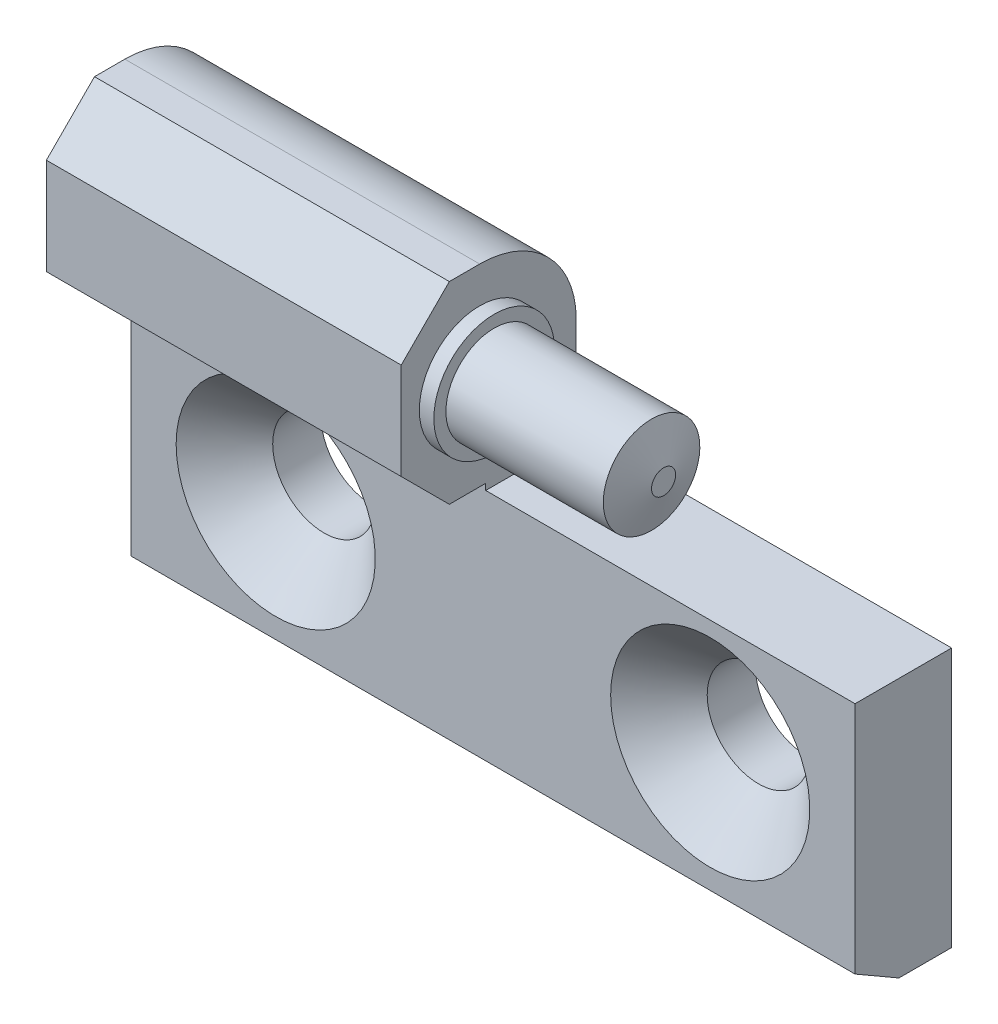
ISO-10303-21;
HEADER;
FILE_DESCRIPTION(('STEP AP214'),'2;1');
FILE_NAME('part.step','',(''),(''),'','','');
FILE_SCHEMA(('AUTOMOTIVE_DESIGN { 1 0 10303 214 1 1 1 1 }'));
ENDSEC;
DATA;
#1=APPLICATION_CONTEXT('core data for automotive mechanical design processes');
#2=APPLICATION_PROTOCOL_DEFINITION('international standard','automotive_design',2000,#1);
#3=PRODUCT_CONTEXT('',#1,'mechanical');
#4=PRODUCT('Part','Part','',(#3));
#5=PRODUCT_RELATED_PRODUCT_CATEGORY('part','',(#4));
#6=PRODUCT_DEFINITION_FORMATION('','',#4);
#7=PRODUCT_DEFINITION_CONTEXT('part definition',#1,'design');
#8=PRODUCT_DEFINITION('design','',#6,#7);
#9=PRODUCT_DEFINITION_SHAPE('','',#8);
#10=(LENGTH_UNIT() NAMED_UNIT(*) SI_UNIT(.MILLI.,.METRE.));
#11=(NAMED_UNIT(*) PLANE_ANGLE_UNIT() SI_UNIT($,.RADIAN.));
#12=(NAMED_UNIT(*) SI_UNIT($,.STERADIAN.) SOLID_ANGLE_UNIT());
#13=UNCERTAINTY_MEASURE_WITH_UNIT(LENGTH_MEASURE(1.E-05),#10,'distance_accuracy_value','');
#14=(GEOMETRIC_REPRESENTATION_CONTEXT(3) GLOBAL_UNCERTAINTY_ASSIGNED_CONTEXT((#13)) GLOBAL_UNIT_ASSIGNED_CONTEXT((#10,
#11,#12)) REPRESENTATION_CONTEXT('',''));
#15=CARTESIAN_POINT('',(0.,0.,0.));
#16=DIRECTION('',(0.,0.,1.));
#17=DIRECTION('',(1.,0.,0.));
#18=AXIS2_PLACEMENT_3D('',#15,#16,#17);
#19=CARTESIAN_POINT('',(48.,-12.,4.36269330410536));
#20=DIRECTION('',(0.,1.,0.));
#21=DIRECTION('',(-1.,0.,0.));
#22=AXIS2_PLACEMENT_3D('',#19,#20,#21);
#23=PLANE('',#22);
#24=DIRECTION('',(0.,0.,-1.));
#25=VECTOR('',#24,1.);
#26=CARTESIAN_POINT('',(-12.,-12.,4.36269330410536));
#27=LINE('',#26,#25);
#28=CARTESIAN_POINT('',(-12.,-12.,4.36269330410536));
#29=VERTEX_POINT('',#28);
#30=CARTESIAN_POINT('',(-12.,-12.,0.));
#31=VERTEX_POINT('',#30);
#32=EDGE_CURVE('E151',#29,#31,#27,.T.);
#33=ORIENTED_EDGE('',*,*,#32,.T.);
#34=DIRECTION('',(-1.,0.,0.));
#35=VECTOR('',#34,1.);
#36=CARTESIAN_POINT('',(48.,-12.,0.));
#37=LINE('',#36,#35);
#38=CARTESIAN_POINT('',(48.,-12.,0.));
#39=VERTEX_POINT('',#38);
#40=EDGE_CURVE('E132',#39,#31,#37,.T.);
#41=ORIENTED_EDGE('',*,*,#40,.F.);
#42=DIRECTION('',(0.,0.,-1.));
#43=VECTOR('',#42,1.);
#44=CARTESIAN_POINT('',(48.,-12.,4.36269330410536));
#45=LINE('',#44,#43);
#46=CARTESIAN_POINT('',(48.,-12.,4.36269330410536));
#47=VERTEX_POINT('',#46);
#48=EDGE_CURVE('E141',#47,#39,#45,.T.);
#49=ORIENTED_EDGE('',*,*,#48,.F.);
#50=DIRECTION('',(-1.,0.,0.));
#51=VECTOR('',#50,1.);
#52=CARTESIAN_POINT('',(48.,-12.,4.36269330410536));
#53=LINE('',#52,#51);
#54=EDGE_CURVE('E150',#47,#29,#53,.T.);
#55=ORIENTED_EDGE('',*,*,#54,.T.);
#56=EDGE_LOOP('',(#33,#41,#49,#55));
#57=FACE_BOUND('',#56,.T.);
#58=ADVANCED_FACE('F14',(#57),#23,.F.);
#59=CARTESIAN_POINT('',(0.,0.,0.));
#60=DIRECTION('',(0.,0.,-1.));
#61=DIRECTION('',(-1.,0.,0.));
#62=AXIS2_PLACEMENT_3D('',#59,#60,#61);
#63=CYLINDRICAL_SURFACE('',#62,4.25);
#64=CARTESIAN_POINT('',(0.,0.,0.));
#65=DIRECTION('',(0.,0.,-1.));
#66=DIRECTION('',(-1.,0.,0.));
#67=AXIS2_PLACEMENT_3D('',#64,#65,#66);
#68=CIRCLE('',#67,4.25);
#69=CARTESIAN_POINT('',(-4.25,0.,0.));
#70=VERTEX_POINT('',#69);
#71=EDGE_CURVE('E250',#70,#70,#68,.T.);
#72=ORIENTED_EDGE('',*,*,#71,.T.);
#73=EDGE_LOOP('',(#72));
#74=FACE_BOUND('',#73,.T.);
#75=CARTESIAN_POINT('',(0.,0.,4.));
#76=DIRECTION('',(0.,0.,-1.));
#77=DIRECTION('',(-1.,0.,0.));
#78=AXIS2_PLACEMENT_3D('',#75,#76,#77);
#79=CIRCLE('',#78,4.25);
#80=CARTESIAN_POINT('',(-4.25,0.,4.));
#81=VERTEX_POINT('',#80);
#82=EDGE_CURVE('E253',#81,#81,#79,.T.);
#83=ORIENTED_EDGE('',*,*,#82,.F.);
#84=EDGE_LOOP('',(#83));
#85=FACE_BOUND('',#84,.T.);
#86=ADVANCED_FACE('F280',(#74,#85),#63,.F.);
#87=CARTESIAN_POINT('',(36.,0.,0.));
#88=DIRECTION('',(0.,0.,-1.));
#89=DIRECTION('',(-1.,0.,0.));
#90=AXIS2_PLACEMENT_3D('',#87,#88,#89);
#91=CYLINDRICAL_SURFACE('',#90,4.25);
#92=CARTESIAN_POINT('',(36.,0.,0.));
#93=DIRECTION('',(0.,0.,-1.));
#94=DIRECTION('',(-1.,0.,0.));
#95=AXIS2_PLACEMENT_3D('',#92,#93,#94);
#96=CIRCLE('',#95,4.25);
#97=CARTESIAN_POINT('',(31.75,0.,0.));
#98=VERTEX_POINT('',#97);
#99=EDGE_CURVE('E241',#98,#98,#96,.T.);
#100=ORIENTED_EDGE('',*,*,#99,.T.);
#101=EDGE_LOOP('',(#100));
#102=FACE_BOUND('',#101,.T.);
#103=CARTESIAN_POINT('',(36.,0.,4.));
#104=DIRECTION('',(0.,0.,-1.));
#105=DIRECTION('',(-1.,0.,0.));
#106=AXIS2_PLACEMENT_3D('',#103,#104,#105);
#107=CIRCLE('',#106,4.25);
#108=CARTESIAN_POINT('',(31.75,0.,4.));
#109=VERTEX_POINT('',#108);
#110=EDGE_CURVE('E244',#109,#109,#107,.T.);
#111=ORIENTED_EDGE('',*,*,#110,.F.);
#112=EDGE_LOOP('',(#111));
#113=FACE_BOUND('',#112,.T.);
#114=ADVANCED_FACE('F287',(#102,#113),#91,.F.);
#115=CARTESIAN_POINT('',(48.,18.,8.5));
#116=DIRECTION('',(1.,0.,0.));
#117=DIRECTION('',(0.,1.,0.));
#118=AXIS2_PLACEMENT_3D('',#115,#116,#117);
#119=PLANE('',#118);
#120=DIRECTION('',(0.,1.,0.));
#121=VECTOR('',#120,1.);
#122=CARTESIAN_POINT('',(48.,-12.,0.));
#123=LINE('',#122,#121);
#124=CARTESIAN_POINT('',(48.,9.5,0.));
#125=VERTEX_POINT('',#124);
#126=EDGE_CURVE('E91',#39,#125,#123,.T.);
#127=ORIENTED_EDGE('',*,*,#126,.T.);
#128=DIRECTION('',(0.,0.,1.));
#129=VECTOR('',#128,1.);
#130=CARTESIAN_POINT('',(48.,9.5,8.5));
#131=LINE('',#130,#129);
#132=CARTESIAN_POINT('',(48.,9.5,8.));
#133=VERTEX_POINT('',#132);
#134=EDGE_CURVE('E127',#125,#133,#131,.T.);
#135=ORIENTED_EDGE('',*,*,#134,.T.);
#136=DIRECTION('',(0.,-1.,0.));
#137=VECTOR('',#136,1.);
#138=CARTESIAN_POINT('',(48.,10.0156402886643,8.));
#139=LINE('',#138,#137);
#140=CARTESIAN_POINT('',(48.,-9.9,8.));
#141=VERTEX_POINT('',#140);
#142=EDGE_CURVE('E143',#133,#141,#139,.T.);
#143=ORIENTED_EDGE('',*,*,#142,.T.);
#144=DIRECTION('',(0.,-0.5,-0.866025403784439));
#145=VECTOR('',#144,1.);
#146=CARTESIAN_POINT('',(48.,-9.9,8.));
#147=LINE('',#146,#145);
#148=EDGE_CURVE('E40',#141,#47,#147,.T.);
#149=ORIENTED_EDGE('',*,*,#148,.T.);
#150=ORIENTED_EDGE('',*,*,#48,.T.);
#151=EDGE_LOOP('',(#127,#135,#143,#149,#150));
#152=FACE_BOUND('',#151,.T.);
#153=ADVANCED_FACE('F139',(#152),#119,.T.);
#154=CARTESIAN_POINT('',(48.,-9.9,8.));
#155=DIRECTION('',(0.,0.866025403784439,-0.5));
#156=DIRECTION('',(0.,0.5,0.866025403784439));
#157=AXIS2_PLACEMENT_3D('',#154,#155,#156);
#158=PLANE('',#157);
#159=DIRECTION('',(0.,-0.5,-0.866025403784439));
#160=VECTOR('',#159,1.);
#161=CARTESIAN_POINT('',(-12.,-9.9,8.));
#162=LINE('',#161,#160);
#163=CARTESIAN_POINT('',(-12.,-9.9,8.));
#164=VERTEX_POINT('',#163);
#165=EDGE_CURVE('E84',#164,#29,#162,.T.);
#166=ORIENTED_EDGE('',*,*,#165,.T.);
#167=ORIENTED_EDGE('',*,*,#54,.F.);
#168=ORIENTED_EDGE('',*,*,#148,.F.);
#169=DIRECTION('',(-1.,0.,0.));
#170=VECTOR('',#169,1.);
#171=CARTESIAN_POINT('',(48.,-9.9,8.));
#172=LINE('',#171,#170);
#173=EDGE_CURVE('E186',#141,#164,#172,.T.);
#174=ORIENTED_EDGE('',*,*,#173,.T.);
#175=EDGE_LOOP('',(#166,#167,#168,#174));
#176=FACE_BOUND('',#175,.T.);
#177=ADVANCED_FACE('F264',(#176),#158,.F.);
#178=CARTESIAN_POINT('',(0.,0.,8.));
#179=DIRECTION('',(0.,0.,1.));
#180=DIRECTION('',(1.,0.,0.));
#181=AXIS2_PLACEMENT_3D('',#178,#179,#180);
#182=CONICAL_SURFACE('',#181,8.25,0.785398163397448);
#183=ORIENTED_EDGE('',*,*,#82,.T.);
#184=EDGE_LOOP('',(#183));
#185=FACE_BOUND('',#184,.T.);
#186=CARTESIAN_POINT('',(0.,0.,8.));
#187=DIRECTION('',(0.,0.,-1.));
#188=DIRECTION('',(-1.,0.,0.));
#189=AXIS2_PLACEMENT_3D('',#186,#187,#188);
#190=CIRCLE('',#189,8.25);
#191=CARTESIAN_POINT('',(-8.25,0.,8.));
#192=VERTEX_POINT('',#191);
#193=EDGE_CURVE('E155',#192,#192,#190,.T.);
#194=ORIENTED_EDGE('',*,*,#193,.F.);
#195=EDGE_LOOP('',(#194));
#196=FACE_BOUND('',#195,.T.);
#197=ADVANCED_FACE('F261',(#185,#196),#182,.F.);
#198=CARTESIAN_POINT('',(36.,0.,8.));
#199=DIRECTION('',(0.,0.,1.));
#200=DIRECTION('',(1.,0.,0.));
#201=AXIS2_PLACEMENT_3D('',#198,#199,#200);
#202=CONICAL_SURFACE('',#201,8.25,0.785398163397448);
#203=ORIENTED_EDGE('',*,*,#110,.T.);
#204=EDGE_LOOP('',(#203));
#205=FACE_BOUND('',#204,.T.);
#206=CARTESIAN_POINT('',(36.,0.,8.));
#207=DIRECTION('',(0.,0.,-1.));
#208=DIRECTION('',(-1.,0.,0.));
#209=AXIS2_PLACEMENT_3D('',#206,#207,#208);
#210=CIRCLE('',#209,8.25);
#211=CARTESIAN_POINT('',(27.75,0.,8.));
#212=VERTEX_POINT('',#211);
#213=EDGE_CURVE('E247',#212,#212,#210,.T.);
#214=ORIENTED_EDGE('',*,*,#213,.F.);
#215=EDGE_LOOP('',(#214));
#216=FACE_BOUND('',#215,.T.);
#217=ADVANCED_FACE('F263',(#205,#216),#202,.F.);
#218=CARTESIAN_POINT('',(-12.,18.,8.5));
#219=DIRECTION('',(1.,0.,0.));
#220=DIRECTION('',(0.,1.,0.));
#221=AXIS2_PLACEMENT_3D('',#218,#219,#220);
#222=PLANE('',#221);
#223=ORIENTED_EDGE('',*,*,#32,.F.);
#224=ORIENTED_EDGE('',*,*,#165,.F.);
#225=DIRECTION('',(0.,-1.,0.));
#226=VECTOR('',#225,1.);
#227=CARTESIAN_POINT('',(-12.,10.0156402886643,8.));
#228=LINE('',#227,#226);
#229=CARTESIAN_POINT('',(-12.,10.0156402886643,8.));
#230=VERTEX_POINT('',#229);
#231=EDGE_CURVE('E182',#230,#164,#228,.T.);
#232=ORIENTED_EDGE('',*,*,#231,.F.);
#233=DIRECTION('',(0.,0.,-1.));
#234=VECTOR('',#233,1.);
#235=CARTESIAN_POINT('',(-12.,10.0156402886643,11.0156402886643));
#236=LINE('',#235,#234);
#237=CARTESIAN_POINT('',(-12.,10.0156402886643,11.0156402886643));
#238=VERTEX_POINT('',#237);
#239=EDGE_CURVE('E179',#238,#230,#236,.T.);
#240=ORIENTED_EDGE('',*,*,#239,.F.);
#241=DIRECTION('',(0.,-0.707106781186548,-0.707106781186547));
#242=VECTOR('',#241,1.);
#243=CARTESIAN_POINT('',(-12.,14.,15.));
#244=LINE('',#243,#242);
#245=CARTESIAN_POINT('',(-12.,14.,15.));
#246=VERTEX_POINT('',#245);
#247=EDGE_CURVE('E176',#246,#238,#244,.T.);
#248=ORIENTED_EDGE('',*,*,#247,.F.);
#249=DIRECTION('',(0.,-1.,0.));
#250=VECTOR('',#249,1.);
#251=CARTESIAN_POINT('',(-12.,22.,15.));
#252=LINE('',#251,#250);
#253=CARTESIAN_POINT('',(-12.,22.,15.));
#254=VERTEX_POINT('',#253);
#255=EDGE_CURVE('E173',#254,#246,#252,.T.);
#256=ORIENTED_EDGE('',*,*,#255,.F.);
#257=DIRECTION('',(0.,-0.708490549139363,0.705720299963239));
#258=VECTOR('',#257,1.);
#259=CARTESIAN_POINT('',(-12.,26.,11.0156402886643));
#260=LINE('',#259,#258);
#261=CARTESIAN_POINT('',(-12.,26.,11.0156402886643));
#262=VERTEX_POINT('',#261);
#263=EDGE_CURVE('E170',#262,#254,#260,.T.);
#264=ORIENTED_EDGE('',*,*,#263,.F.);
#265=DIRECTION('',(0.,0.,1.));
#266=VECTOR('',#265,1.);
#267=CARTESIAN_POINT('',(-12.,26.,8.5));
#268=LINE('',#267,#266);
#269=CARTESIAN_POINT('',(-12.,26.,8.5));
#270=VERTEX_POINT('',#269);
#271=EDGE_CURVE('E167',#270,#262,#268,.T.);
#272=ORIENTED_EDGE('',*,*,#271,.F.);
#273=CARTESIAN_POINT('',(-12.,18.,8.5));
#274=DIRECTION('',(1.,0.,0.));
#275=DIRECTION('',(0.,1.,0.));
#276=AXIS2_PLACEMENT_3D('',#273,#274,#275);
#277=CIRCLE('',#276,8.);
#278=CARTESIAN_POINT('',(-12.,18.,0.5));
#279=VERTEX_POINT('',#278);
#280=EDGE_CURVE('E164',#279,#270,#277,.T.);
#281=ORIENTED_EDGE('',*,*,#280,.F.);
#282=DIRECTION('',(0.,1.,0.));
#283=VECTOR('',#282,1.);
#284=CARTESIAN_POINT('',(-12.,14.,0.5));
#285=LINE('',#284,#283);
#286=CARTESIAN_POINT('',(-12.,14.,0.5));
#287=VERTEX_POINT('',#286);
#288=EDGE_CURVE('E161',#287,#279,#285,.T.);
#289=ORIENTED_EDGE('',*,*,#288,.F.);
#290=DIRECTION('',(0.,0.,1.));
#291=VECTOR('',#290,1.);
#292=CARTESIAN_POINT('',(-12.,14.,0.));
#293=LINE('',#292,#291);
#294=CARTESIAN_POINT('',(-12.,14.,0.));
#295=VERTEX_POINT('',#294);
#296=EDGE_CURVE('E158',#295,#287,#293,.T.);
#297=ORIENTED_EDGE('',*,*,#296,.F.);
#298=DIRECTION('',(0.,1.,0.));
#299=VECTOR('',#298,1.);
#300=CARTESIAN_POINT('',(-12.,-12.,0.));
#301=LINE('',#300,#299);
#302=EDGE_CURVE('E154',#31,#295,#301,.T.);
#303=ORIENTED_EDGE('',*,*,#302,.F.);
#304=EDGE_LOOP('',(#223,#224,#232,#240,#248,#256,#264,#272,#281,#289,#297,#303));
#305=FACE_BOUND('',#304,.T.);
#306=ADVANCED_FACE('F273',(#305),#222,.F.);
#307=CARTESIAN_POINT('',(48.,-12.,0.));
#308=DIRECTION('',(0.,0.,1.));
#309=DIRECTION('',(1.,0.,0.));
#310=AXIS2_PLACEMENT_3D('',#307,#308,#309);
#311=PLANE('',#310);
#312=ORIENTED_EDGE('',*,*,#99,.F.);
#313=EDGE_LOOP('',(#312));
#314=FACE_BOUND('',#313,.T.);
#315=ORIENTED_EDGE('',*,*,#71,.F.);
#316=EDGE_LOOP('',(#315));
#317=FACE_BOUND('',#316,.T.);
#318=DIRECTION('',(-1.,0.,0.));
#319=VECTOR('',#318,1.);
#320=CARTESIAN_POINT('',(48.,9.5,0.));
#321=LINE('',#320,#319);
#322=CARTESIAN_POINT('',(17.4,9.5,0.));
#323=VERTEX_POINT('',#322);
#324=EDGE_CURVE('E129',#125,#323,#321,.T.);
#325=ORIENTED_EDGE('',*,*,#324,.F.);
#326=ORIENTED_EDGE('',*,*,#126,.F.);
#327=ORIENTED_EDGE('',*,*,#40,.T.);
#328=ORIENTED_EDGE('',*,*,#302,.T.);
#329=DIRECTION('',(-1.,0.,0.));
#330=VECTOR('',#329,1.);
#331=CARTESIAN_POINT('',(48.,14.,0.));
#332=LINE('',#331,#330);
#333=CARTESIAN_POINT('',(17.4,14.,0.));
#334=VERTEX_POINT('',#333);
#335=EDGE_CURVE('E204',#334,#295,#332,.T.);
#336=ORIENTED_EDGE('',*,*,#335,.F.);
#337=DIRECTION('',(0.,1.,0.));
#338=VECTOR('',#337,1.);
#339=CARTESIAN_POINT('',(17.4,9.5,0.));
#340=LINE('',#339,#338);
#341=EDGE_CURVE('E136',#323,#334,#340,.T.);
#342=ORIENTED_EDGE('',*,*,#341,.F.);
#343=EDGE_LOOP('',(#325,#326,#327,#328,#336,#342));
#344=FACE_BOUND('',#343,.T.);
#345=ADVANCED_FACE('F134',(#314,#317,#344),#311,.F.);
#346=CARTESIAN_POINT('',(48.,9.5,15.));
#347=DIRECTION('',(0.,1.,0.));
#348=DIRECTION('',(-1.,0.,0.));
#349=AXIS2_PLACEMENT_3D('',#346,#347,#348);
#350=PLANE('',#349);
#351=DIRECTION('',(1.,0.,0.));
#352=VECTOR('',#351,1.);
#353=CARTESIAN_POINT('',(48.,9.5,8.));
#354=LINE('',#353,#352);
#355=CARTESIAN_POINT('',(17.4,9.5,8.));
#356=VERTEX_POINT('',#355);
#357=EDGE_CURVE('E31',#356,#133,#354,.T.);
#358=ORIENTED_EDGE('',*,*,#357,.T.);
#359=ORIENTED_EDGE('',*,*,#134,.F.);
#360=ORIENTED_EDGE('',*,*,#324,.T.);
#361=DIRECTION('',(0.,0.,-1.));
#362=VECTOR('',#361,1.);
#363=CARTESIAN_POINT('',(17.4,9.5,15.));
#364=LINE('',#363,#362);
#365=EDGE_CURVE('E218',#356,#323,#364,.T.);
#366=ORIENTED_EDGE('',*,*,#365,.F.);
#367=EDGE_LOOP('',(#358,#359,#360,#366));
#368=FACE_BOUND('',#367,.T.);
#369=ADVANCED_FACE('F128',(#368),#350,.T.);
#370=CARTESIAN_POINT('',(48.,10.0156402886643,8.));
#371=DIRECTION('',(0.,0.,-1.));
#372=DIRECTION('',(-1.,0.,0.));
#373=AXIS2_PLACEMENT_3D('',#370,#371,#372);
#374=PLANE('',#373);
#375=ORIENTED_EDGE('',*,*,#213,.T.);
#376=EDGE_LOOP('',(#375));
#377=FACE_BOUND('',#376,.T.);
#378=ORIENTED_EDGE('',*,*,#193,.T.);
#379=EDGE_LOOP('',(#378));
#380=FACE_BOUND('',#379,.T.);
#381=ORIENTED_EDGE('',*,*,#357,.F.);
#382=DIRECTION('',(0.,-1.,0.));
#383=VECTOR('',#382,1.);
#384=CARTESIAN_POINT('',(17.4,10.0156402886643,8.));
#385=LINE('',#384,#383);
#386=CARTESIAN_POINT('',(17.4,10.0156402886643,8.));
#387=VERTEX_POINT('',#386);
#388=EDGE_CURVE('E231',#387,#356,#385,.T.);
#389=ORIENTED_EDGE('',*,*,#388,.F.);
#390=DIRECTION('',(-1.,0.,0.));
#391=VECTOR('',#390,1.);
#392=CARTESIAN_POINT('',(48.,10.0156402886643,8.));
#393=LINE('',#392,#391);
#394=EDGE_CURVE('E188',#387,#230,#393,.T.);
#395=ORIENTED_EDGE('',*,*,#394,.T.);
#396=ORIENTED_EDGE('',*,*,#231,.T.);
#397=ORIENTED_EDGE('',*,*,#173,.F.);
#398=ORIENTED_EDGE('',*,*,#142,.F.);
#399=EDGE_LOOP('',(#381,#389,#395,#396,#397,#398));
#400=FACE_BOUND('',#399,.T.);
#401=ADVANCED_FACE('F258',(#377,#380,#400),#374,.F.);
#402=CARTESIAN_POINT('',(48.,10.0156402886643,11.0156402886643));
#403=DIRECTION('',(0.,1.,0.));
#404=DIRECTION('',(-1.,0.,0.));
#405=AXIS2_PLACEMENT_3D('',#402,#403,#404);
#406=PLANE('',#405);
#407=DIRECTION('',(0.,0.,-1.));
#408=VECTOR('',#407,1.);
#409=CARTESIAN_POINT('',(17.4,10.0156402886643,11.0156402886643));
#410=LINE('',#409,#408);
#411=CARTESIAN_POINT('',(17.4,10.0156402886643,11.0156402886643));
#412=VERTEX_POINT('',#411);
#413=EDGE_CURVE('E23',#412,#387,#410,.T.);
#414=ORIENTED_EDGE('',*,*,#413,.F.);
#415=DIRECTION('',(-1.,0.,0.));
#416=VECTOR('',#415,1.);
#417=CARTESIAN_POINT('',(48.,10.0156402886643,11.0156402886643));
#418=LINE('',#417,#416);
#419=EDGE_CURVE('E190',#412,#238,#418,.T.);
#420=ORIENTED_EDGE('',*,*,#419,.T.);
#421=ORIENTED_EDGE('',*,*,#239,.T.);
#422=ORIENTED_EDGE('',*,*,#394,.F.);
#423=EDGE_LOOP('',(#414,#420,#421,#422));
#424=FACE_BOUND('',#423,.T.);
#425=ADVANCED_FACE('F341',(#424),#406,.F.);
#426=CARTESIAN_POINT('',(48.,14.,15.));
#427=DIRECTION('',(0.,0.707106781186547,-0.707106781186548));
#428=DIRECTION('',(0.,0.707106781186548,0.707106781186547));
#429=AXIS2_PLACEMENT_3D('',#426,#427,#428);
#430=PLANE('',#429);
#431=DIRECTION('',(0.,-0.707106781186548,-0.707106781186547));
#432=VECTOR('',#431,1.);
#433=CARTESIAN_POINT('',(17.4,14.,15.));
#434=LINE('',#433,#432);
#435=CARTESIAN_POINT('',(17.4,14.,15.));
#436=VERTEX_POINT('',#435);
#437=EDGE_CURVE('E229',#436,#412,#434,.T.);
#438=ORIENTED_EDGE('',*,*,#437,.F.);
#439=DIRECTION('',(-1.,0.,0.));
#440=VECTOR('',#439,1.);
#441=CARTESIAN_POINT('',(48.,14.,15.));
#442=LINE('',#441,#440);
#443=EDGE_CURVE('E192',#436,#246,#442,.T.);
#444=ORIENTED_EDGE('',*,*,#443,.T.);
#445=ORIENTED_EDGE('',*,*,#247,.T.);
#446=ORIENTED_EDGE('',*,*,#419,.F.);
#447=EDGE_LOOP('',(#438,#444,#445,#446));
#448=FACE_BOUND('',#447,.T.);
#449=ADVANCED_FACE('F347',(#448),#430,.F.);
#450=CARTESIAN_POINT('',(48.,22.,15.));
#451=DIRECTION('',(0.,0.,-1.));
#452=DIRECTION('',(-1.,0.,0.));
#453=AXIS2_PLACEMENT_3D('',#450,#451,#452);
#454=PLANE('',#453);
#455=DIRECTION('',(0.,-1.,0.));
#456=VECTOR('',#455,1.);
#457=CARTESIAN_POINT('',(17.4,26.,15.));
#458=LINE('',#457,#456);
#459=CARTESIAN_POINT('',(17.4,22.,15.));
#460=VERTEX_POINT('',#459);
#461=EDGE_CURVE('E137',#460,#436,#458,.T.);
#462=ORIENTED_EDGE('',*,*,#461,.F.);
#463=DIRECTION('',(-1.,0.,0.));
#464=VECTOR('',#463,1.);
#465=CARTESIAN_POINT('',(48.,22.,15.));
#466=LINE('',#465,#464);
#467=EDGE_CURVE('E194',#460,#254,#466,.T.);
#468=ORIENTED_EDGE('',*,*,#467,.T.);
#469=ORIENTED_EDGE('',*,*,#255,.T.);
#470=ORIENTED_EDGE('',*,*,#443,.F.);
#471=EDGE_LOOP('',(#462,#468,#469,#470));
#472=FACE_BOUND('',#471,.T.);
#473=ADVANCED_FACE('F354',(#472),#454,.F.);
#474=CARTESIAN_POINT('',(48.,26.,11.0156402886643));
#475=DIRECTION('',(0.,-0.705720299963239,-0.708490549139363));
#476=DIRECTION('',(0.,0.708490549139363,-0.705720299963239));
#477=AXIS2_PLACEMENT_3D('',#474,#475,#476);
#478=PLANE('',#477);
#479=DIRECTION('',(0.,-0.708490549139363,0.705720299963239));
#480=VECTOR('',#479,1.);
#481=CARTESIAN_POINT('',(17.4,26.,11.0156402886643));
#482=LINE('',#481,#480);
#483=CARTESIAN_POINT('',(17.4,26.,11.0156402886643));
#484=VERTEX_POINT('',#483);
#485=EDGE_CURVE('E233',#484,#460,#482,.T.);
#486=ORIENTED_EDGE('',*,*,#485,.F.);
#487=DIRECTION('',(-1.,0.,0.));
#488=VECTOR('',#487,1.);
#489=CARTESIAN_POINT('',(48.,26.,11.0156402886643));
#490=LINE('',#489,#488);
#491=EDGE_CURVE('E196',#484,#262,#490,.T.);
#492=ORIENTED_EDGE('',*,*,#491,.T.);
#493=ORIENTED_EDGE('',*,*,#263,.T.);
#494=ORIENTED_EDGE('',*,*,#467,.F.);
#495=EDGE_LOOP('',(#486,#492,#493,#494));
#496=FACE_BOUND('',#495,.T.);
#497=ADVANCED_FACE('F358',(#496),#478,.F.);
#498=CARTESIAN_POINT('',(48.,26.,8.5));
#499=DIRECTION('',(0.,-1.,0.));
#500=DIRECTION('',(1.,0.,0.));
#501=AXIS2_PLACEMENT_3D('',#498,#499,#500);
#502=PLANE('',#501);
#503=DIRECTION('',(0.,0.,1.));
#504=VECTOR('',#503,1.);
#505=CARTESIAN_POINT('',(17.4,26.,0.));
#506=LINE('',#505,#504);
#507=CARTESIAN_POINT('',(17.4,26.,8.5));
#508=VERTEX_POINT('',#507);
#509=EDGE_CURVE('E223',#508,#484,#506,.T.);
#510=ORIENTED_EDGE('',*,*,#509,.F.);
#511=DIRECTION('',(-1.,0.,0.));
#512=VECTOR('',#511,1.);
#513=CARTESIAN_POINT('',(48.,26.,8.5));
#514=LINE('',#513,#512);
#515=EDGE_CURVE('E198',#508,#270,#514,.T.);
#516=ORIENTED_EDGE('',*,*,#515,.T.);
#517=ORIENTED_EDGE('',*,*,#271,.T.);
#518=ORIENTED_EDGE('',*,*,#491,.F.);
#519=EDGE_LOOP('',(#510,#516,#517,#518));
#520=FACE_BOUND('',#519,.T.);
#521=ADVANCED_FACE('F362',(#520),#502,.F.);
#522=CARTESIAN_POINT('',(48.,18.,8.5));
#523=DIRECTION('',(-1.,0.,0.));
#524=DIRECTION('',(0.,-1.,0.));
#525=AXIS2_PLACEMENT_3D('',#522,#523,#524);
#526=CYLINDRICAL_SURFACE('',#525,8.);
#527=CARTESIAN_POINT('',(17.4,18.,8.5));
#528=DIRECTION('',(1.,0.,0.));
#529=DIRECTION('',(0.,1.,0.));
#530=AXIS2_PLACEMENT_3D('',#527,#528,#529);
#531=CIRCLE('',#530,8.);
#532=CARTESIAN_POINT('',(17.4,18.,0.5));
#533=VERTEX_POINT('',#532);
#534=EDGE_CURVE('E235',#533,#508,#531,.T.);
#535=ORIENTED_EDGE('',*,*,#534,.F.);
#536=DIRECTION('',(-1.,0.,0.));
#537=VECTOR('',#536,1.);
#538=CARTESIAN_POINT('',(48.,18.,0.5));
#539=LINE('',#538,#537);
#540=EDGE_CURVE('E200',#533,#279,#539,.T.);
#541=ORIENTED_EDGE('',*,*,#540,.T.);
#542=ORIENTED_EDGE('',*,*,#280,.T.);
#543=ORIENTED_EDGE('',*,*,#515,.F.);
#544=EDGE_LOOP('',(#535,#541,#542,#543));
#545=FACE_BOUND('',#544,.T.);
#546=ADVANCED_FACE('F366',(#545),#526,.T.);
#547=CARTESIAN_POINT('',(48.,14.,0.5));
#548=DIRECTION('',(0.,0.,1.));
#549=DIRECTION('',(1.,0.,0.));
#550=AXIS2_PLACEMENT_3D('',#547,#548,#549);
#551=PLANE('',#550);
#552=DIRECTION('',(0.,1.,0.));
#553=VECTOR('',#552,1.);
#554=CARTESIAN_POINT('',(17.4,14.,0.5));
#555=LINE('',#554,#553);
#556=CARTESIAN_POINT('',(17.4,14.,0.5));
#557=VERTEX_POINT('',#556);
#558=EDGE_CURVE('E237',#557,#533,#555,.T.);
#559=ORIENTED_EDGE('',*,*,#558,.F.);
#560=DIRECTION('',(-1.,0.,0.));
#561=VECTOR('',#560,1.);
#562=CARTESIAN_POINT('',(48.,14.,0.5));
#563=LINE('',#562,#561);
#564=EDGE_CURVE('E202',#557,#287,#563,.T.);
#565=ORIENTED_EDGE('',*,*,#564,.T.);
#566=ORIENTED_EDGE('',*,*,#288,.T.);
#567=ORIENTED_EDGE('',*,*,#540,.F.);
#568=EDGE_LOOP('',(#559,#565,#566,#567));
#569=FACE_BOUND('',#568,.T.);
#570=ADVANCED_FACE('F322',(#569),#551,.F.);
#571=CARTESIAN_POINT('',(48.,14.,0.));
#572=DIRECTION('',(0.,-1.,0.));
#573=DIRECTION('',(1.,0.,0.));
#574=AXIS2_PLACEMENT_3D('',#571,#572,#573);
#575=PLANE('',#574);
#576=DIRECTION('',(0.,0.,1.));
#577=VECTOR('',#576,1.);
#578=CARTESIAN_POINT('',(17.4,14.,0.));
#579=LINE('',#578,#577);
#580=EDGE_CURVE('E239',#334,#557,#579,.T.);
#581=ORIENTED_EDGE('',*,*,#580,.F.);
#582=ORIENTED_EDGE('',*,*,#335,.T.);
#583=ORIENTED_EDGE('',*,*,#296,.T.);
#584=ORIENTED_EDGE('',*,*,#564,.F.);
#585=EDGE_LOOP('',(#581,#582,#583,#584));
#586=FACE_BOUND('',#585,.T.);
#587=ADVANCED_FACE('F316',(#586),#575,.F.);
#588=CARTESIAN_POINT('',(17.4,-12.,0.));
#589=DIRECTION('',(1.,0.,0.));
#590=DIRECTION('',(0.,1.,0.));
#591=AXIS2_PLACEMENT_3D('',#588,#589,#590);
#592=PLANE('',#591);
#593=ORIENTED_EDGE('',*,*,#580,.T.);
#594=ORIENTED_EDGE('',*,*,#558,.T.);
#595=ORIENTED_EDGE('',*,*,#534,.T.);
#596=ORIENTED_EDGE('',*,*,#509,.T.);
#597=ORIENTED_EDGE('',*,*,#485,.T.);
#598=ORIENTED_EDGE('',*,*,#461,.T.);
#599=ORIENTED_EDGE('',*,*,#437,.T.);
#600=ORIENTED_EDGE('',*,*,#413,.T.);
#601=ORIENTED_EDGE('',*,*,#388,.T.);
#602=ORIENTED_EDGE('',*,*,#365,.T.);
#603=ORIENTED_EDGE('',*,*,#341,.T.);
#604=EDGE_LOOP('',(#593,#594,#595,#596,#597,#598,#599,#600,#601,#602,#603));
#605=FACE_BOUND('',#604,.T.);
#606=CARTESIAN_POINT('',(17.4,18.,8.5));
#607=DIRECTION('',(1.,0.,0.));
#608=DIRECTION('',(0.,-1.,0.));
#609=AXIS2_PLACEMENT_3D('',#606,#607,#608);
#610=CIRCLE('',#609,5.);
#611=CARTESIAN_POINT('',(17.4,13.,8.5));
#612=VERTEX_POINT('',#611);
#613=EDGE_CURVE('E9',#612,#612,#610,.F.);
#614=ORIENTED_EDGE('',*,*,#613,.T.);
#615=EDGE_LOOP('',(#614));
#616=FACE_BOUND('',#615,.T.);
#617=ADVANCED_FACE('F310',(#605,#616),#592,.T.);
#618=CARTESIAN_POINT('',(32.64,18.,8.5));
#619=DIRECTION('',(-1.,0.,0.));
#620=DIRECTION('',(0.,1.,0.));
#621=AXIS2_PLACEMENT_3D('',#618,#619,#620);
#622=PLANE('',#621);
#623=CARTESIAN_POINT('',(32.64,18.,8.5));
#624=DIRECTION('',(-1.,0.,0.));
#625=DIRECTION('',(0.,1.,0.));
#626=AXIS2_PLACEMENT_3D('',#623,#624,#625);
#627=CIRCLE('',#626,1.);
#628=CARTESIAN_POINT('',(32.64,19.,8.5));
#629=VERTEX_POINT('',#628);
#630=EDGE_CURVE('E18',#629,#629,#627,.T.);
#631=ORIENTED_EDGE('',*,*,#630,.F.);
#632=EDGE_LOOP('',(#631));
#633=FACE_BOUND('',#632,.T.);
#634=ADVANCED_FACE('F16',(#633),#622,.F.);
#635=CARTESIAN_POINT('',(32.64,18.,8.5));
#636=DIRECTION('',(-1.,0.,0.));
#637=DIRECTION('',(0.,1.,0.));
#638=AXIS2_PLACEMENT_3D('',#635,#636,#637);
#639=CONICAL_SURFACE('',#638,1.,1.24904577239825);
#640=CARTESIAN_POINT('',(31.64,18.,8.5));
#641=DIRECTION('',(-1.,0.,0.));
#642=DIRECTION('',(0.,1.,0.));
#643=AXIS2_PLACEMENT_3D('',#640,#641,#642);
#644=CIRCLE('',#643,4.);
#645=CARTESIAN_POINT('',(31.64,22.,8.5));
#646=VERTEX_POINT('',#645);
#647=EDGE_CURVE('E213',#646,#646,#644,.T.);
#648=CARTESIAN_POINT('',(31.64,22.,8.5));
#649=CARTESIAN_POINT('',(31.6504166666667,21.96875,8.5));
#650=CARTESIAN_POINT('',(31.6608333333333,21.9375,8.5));
#651=CARTESIAN_POINT('',(31.6816666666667,21.875,8.5));
#652=CARTESIAN_POINT('',(31.6920833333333,21.84375,8.5));
#653=CARTESIAN_POINT('',(31.7129166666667,21.78125,8.5));
#654=CARTESIAN_POINT('',(31.7233333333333,21.75,8.5));
#655=CARTESIAN_POINT('',(31.7441666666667,21.6875,8.5));
#656=CARTESIAN_POINT('',(31.7545833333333,21.65625,8.5));
#657=CARTESIAN_POINT('',(31.7754166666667,21.59375,8.5));
#658=CARTESIAN_POINT('',(31.7858333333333,21.5625,8.5));
#659=CARTESIAN_POINT('',(31.8066666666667,21.5,8.5));
#660=CARTESIAN_POINT('',(31.8170833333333,21.46875,8.5));
#661=CARTESIAN_POINT('',(31.8379166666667,21.40625,8.5));
#662=CARTESIAN_POINT('',(31.8483333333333,21.375,8.5));
#663=CARTESIAN_POINT('',(31.8691666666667,21.3125,8.5));
#664=CARTESIAN_POINT('',(31.8795833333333,21.28125,8.5));
#665=CARTESIAN_POINT('',(31.9004166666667,21.21875,8.5));
#666=CARTESIAN_POINT('',(31.9108333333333,21.1875,8.5));
#667=CARTESIAN_POINT('',(31.9316666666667,21.125,8.5));
#668=CARTESIAN_POINT('',(31.9420833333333,21.09375,8.5));
#669=CARTESIAN_POINT('',(31.9629166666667,21.03125,8.5));
#670=CARTESIAN_POINT('',(31.9733333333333,21.,8.5));
#671=CARTESIAN_POINT('',(31.9941666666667,20.9375,8.5));
#672=CARTESIAN_POINT('',(32.0045833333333,20.90625,8.5));
#673=CARTESIAN_POINT('',(32.0254166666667,20.84375,8.5));
#674=CARTESIAN_POINT('',(32.0358333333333,20.8125,8.5));
#675=CARTESIAN_POINT('',(32.0566666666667,20.75,8.5));
#676=CARTESIAN_POINT('',(32.0670833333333,20.71875,8.5));
#677=CARTESIAN_POINT('',(32.0879166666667,20.65625,8.5));
#678=CARTESIAN_POINT('',(32.0983333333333,20.625,8.5));
#679=CARTESIAN_POINT('',(32.1191666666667,20.5625,8.5));
#680=CARTESIAN_POINT('',(32.1295833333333,20.53125,8.5));
#681=CARTESIAN_POINT('',(32.1504166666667,20.46875,8.5));
#682=CARTESIAN_POINT('',(32.1608333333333,20.4375,8.5));
#683=CARTESIAN_POINT('',(32.1816666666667,20.375,8.5));
#684=CARTESIAN_POINT('',(32.1920833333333,20.34375,8.5));
#685=CARTESIAN_POINT('',(32.2129166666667,20.28125,8.5));
#686=CARTESIAN_POINT('',(32.2233333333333,20.25,8.5));
#687=CARTESIAN_POINT('',(32.2441666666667,20.1875,8.5));
#688=CARTESIAN_POINT('',(32.2545833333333,20.15625,8.5));
#689=CARTESIAN_POINT('',(32.2754166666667,20.09375,8.5));
#690=CARTESIAN_POINT('',(32.2858333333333,20.0625,8.5));
#691=CARTESIAN_POINT('',(32.3066666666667,20.,8.5));
#692=CARTESIAN_POINT('',(32.3170833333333,19.96875,8.5));
#693=CARTESIAN_POINT('',(32.3379166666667,19.90625,8.5));
#694=CARTESIAN_POINT('',(32.3483333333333,19.875,8.5));
#695=CARTESIAN_POINT('',(32.3691666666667,19.8125,8.5));
#696=CARTESIAN_POINT('',(32.3795833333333,19.78125,8.5));
#697=CARTESIAN_POINT('',(32.4004166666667,19.71875,8.5));
#698=CARTESIAN_POINT('',(32.4108333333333,19.6875,8.5));
#699=CARTESIAN_POINT('',(32.4316666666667,19.625,8.5));
#700=CARTESIAN_POINT('',(32.4420833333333,19.59375,8.5));
#701=CARTESIAN_POINT('',(32.4629166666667,19.53125,8.5));
#702=CARTESIAN_POINT('',(32.4733333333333,19.5,8.5));
#703=CARTESIAN_POINT('',(32.4941666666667,19.4375,8.5));
#704=CARTESIAN_POINT('',(32.5045833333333,19.40625,8.5));
#705=CARTESIAN_POINT('',(32.5254166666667,19.34375,8.5));
#706=CARTESIAN_POINT('',(32.5358333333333,19.3125,8.5));
#707=CARTESIAN_POINT('',(32.5566666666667,19.25,8.5));
#708=CARTESIAN_POINT('',(32.5670833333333,19.21875,8.5));
#709=CARTESIAN_POINT('',(32.5879166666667,19.15625,8.5));
#710=CARTESIAN_POINT('',(32.5983333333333,19.125,8.5));
#711=CARTESIAN_POINT('',(32.6191666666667,19.0625,8.5));
#712=CARTESIAN_POINT('',(32.6295833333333,19.03125,8.5));
#713=CARTESIAN_POINT('',(32.64,19.,8.5));
#714=B_SPLINE_CURVE_WITH_KNOTS('',3,(#648,#649,#650,#651,#652,#653,#654,#655,#656,#657,#658,
#659,#660,#661,#662,#663,#664,#665,#666,#667,#668,#669,#670,#671,#672,#673,#674,#675,#676,#677,
#678,#679,#680,#681,#682,#683,#684,#685,#686,#687,#688,#689,#690,#691,#692,#693,#694,#695,#696,
#697,#698,#699,#700,#701,#702,#703,#704,#705,#706,#707,#708,#709,#710,#711,#712,#713),
.UNSPECIFIED.,.F.,.F.,(4,2,2,2,2,2,2,2,2,2,2,2,2,2,2,2,2,2,2,2,2,2,2,2,2,2,2,2,2,2,2,2,4),(0.,
0.098821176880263,0.197642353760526,0.296463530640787,0.395284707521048,0.494105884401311,
0.592927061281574,0.691748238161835,0.790569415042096,0.889390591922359,0.988211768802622,
1.08703294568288,1.18585412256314,1.28467529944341,1.38349647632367,1.48231765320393,
1.58113883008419,1.67996000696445,1.77878118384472,1.87760236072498,1.97642353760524,
2.0752447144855,2.17406589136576,2.27288706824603,2.37170824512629,2.47052942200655,
2.56935059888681,2.66817177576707,2.76699295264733,2.8658141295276,2.96463530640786,
3.06345648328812,3.16227766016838),.UNSPECIFIED.);
#715=EDGE_CURVE('BSEAM302',#646,#629,#714,.T.);
#716=ORIENTED_EDGE('',*,*,#647,.F.);
#717=ORIENTED_EDGE('',*,*,#630,.T.);
#718=ORIENTED_EDGE('',*,*,#715,.T.);
#719=ORIENTED_EDGE('',*,*,#715,.F.);
#720=EDGE_LOOP('',(#716,#718,#717,#719));
#721=FACE_BOUND('',#720,.T.);
#722=ADVANCED_FACE('F302',(#721),#639,.T.);
#723=CARTESIAN_POINT('',(-32.6,18.,8.5));
#724=DIRECTION('',(-1.,0.,0.));
#725=DIRECTION('',(0.,1.,0.));
#726=AXIS2_PLACEMENT_3D('',#723,#724,#725);
#727=CYLINDRICAL_SURFACE('',#726,4.);
#728=CARTESIAN_POINT('',(18.6,18.,8.5));
#729=DIRECTION('',(-1.,0.,0.));
#730=DIRECTION('',(0.,1.,0.));
#731=AXIS2_PLACEMENT_3D('',#728,#729,#730);
#732=CIRCLE('',#731,4.);
#733=CARTESIAN_POINT('',(18.6,22.,8.5));
#734=VERTEX_POINT('',#733);
#735=EDGE_CURVE('E211',#734,#734,#732,.T.);
#736=ORIENTED_EDGE('',*,*,#735,.F.);
#737=EDGE_LOOP('',(#736));
#738=FACE_BOUND('',#737,.T.);
#739=ORIENTED_EDGE('',*,*,#647,.T.);
#740=EDGE_LOOP('',(#739));
#741=FACE_BOUND('',#740,.T.);
#742=ADVANCED_FACE('F299',(#738,#741),#727,.T.);
#743=CARTESIAN_POINT('',(18.6,22.,8.5));
#744=DIRECTION('',(-1.,0.,0.));
#745=DIRECTION('',(0.,1.,0.));
#746=AXIS2_PLACEMENT_3D('',#743,#744,#745);
#747=PLANE('',#746);
#748=CARTESIAN_POINT('',(18.6,18.,8.5));
#749=DIRECTION('',(-1.,0.,0.));
#750=DIRECTION('',(0.,1.,0.));
#751=AXIS2_PLACEMENT_3D('',#748,#749,#750);
#752=CIRCLE('',#751,5.);
#753=CARTESIAN_POINT('',(18.6,23.,8.5));
#754=VERTEX_POINT('',#753);
#755=EDGE_CURVE('E208',#754,#754,#752,.T.);
#756=ORIENTED_EDGE('',*,*,#755,.F.);
#757=EDGE_LOOP('',(#756));
#758=FACE_BOUND('',#757,.T.);
#759=ORIENTED_EDGE('',*,*,#735,.T.);
#760=EDGE_LOOP('',(#759));
#761=FACE_BOUND('',#760,.T.);
#762=ADVANCED_FACE('F295',(#758,#761),#747,.F.);
#763=CARTESIAN_POINT('',(-32.6,18.,8.5));
#764=DIRECTION('',(-1.,0.,0.));
#765=DIRECTION('',(0.,1.,0.));
#766=AXIS2_PLACEMENT_3D('',#763,#764,#765);
#767=CYLINDRICAL_SURFACE('',#766,5.);
#768=ORIENTED_EDGE('',*,*,#613,.F.);
#769=EDGE_LOOP('',(#768));
#770=FACE_BOUND('',#769,.T.);
#771=ORIENTED_EDGE('',*,*,#755,.T.);
#772=EDGE_LOOP('',(#771));
#773=FACE_BOUND('',#772,.T.);
#774=ADVANCED_FACE('F292',(#770,#773),#767,.T.);
#775=CLOSED_SHELL('',(#58,#86,#114,#153,#177,#197,#217,#306,#345,#369,#401,#425,#449,#473,#497,
#521,#546,#570,#587,#617,#634,#722,#742,#762,#774));
#776=MANIFOLD_SOLID_BREP('B1',#775);
#777=ADVANCED_BREP_SHAPE_REPRESENTATION('',(#18,#776),#14);
#778=SHAPE_DEFINITION_REPRESENTATION(#9,#777);
ENDSEC;
END-ISO-10303-21;
